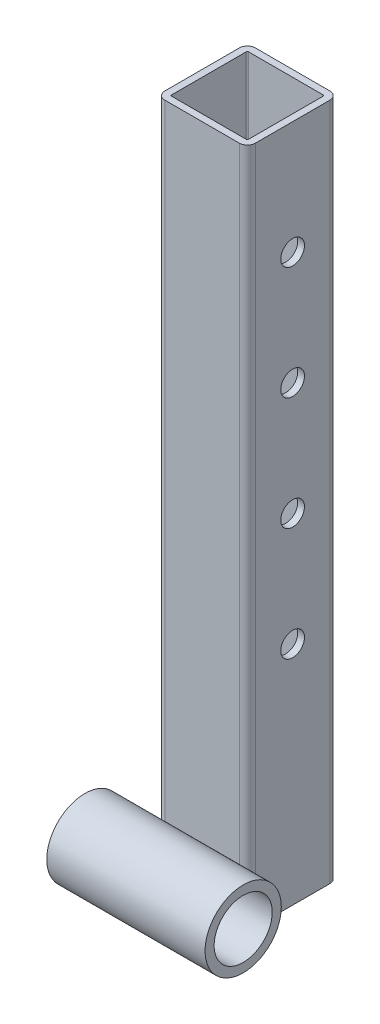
ISO-10303-21;
HEADER;
FILE_DESCRIPTION(('STEP AP214'),'2;1');
FILE_NAME('part.step','',(''),(''),'','','');
FILE_SCHEMA(('AUTOMOTIVE_DESIGN { 1 0 10303 214 1 1 1 1 }'));
ENDSEC;
DATA;
#1=APPLICATION_CONTEXT('core data for automotive mechanical design processes');
#2=APPLICATION_PROTOCOL_DEFINITION('international standard','automotive_design',2000,#1);
#3=PRODUCT_CONTEXT('',#1,'mechanical');
#4=PRODUCT('Part','Part','',(#3));
#5=PRODUCT_RELATED_PRODUCT_CATEGORY('part','',(#4));
#6=PRODUCT_DEFINITION_FORMATION('','',#4);
#7=PRODUCT_DEFINITION_CONTEXT('part definition',#1,'design');
#8=PRODUCT_DEFINITION('design','',#6,#7);
#9=PRODUCT_DEFINITION_SHAPE('','',#8);
#10=(LENGTH_UNIT() NAMED_UNIT(*) SI_UNIT(.MILLI.,.METRE.));
#11=(NAMED_UNIT(*) PLANE_ANGLE_UNIT() SI_UNIT($,.RADIAN.));
#12=(NAMED_UNIT(*) SI_UNIT($,.STERADIAN.) SOLID_ANGLE_UNIT());
#13=UNCERTAINTY_MEASURE_WITH_UNIT(LENGTH_MEASURE(1.E-05),#10,'distance_accuracy_value','');
#14=(GEOMETRIC_REPRESENTATION_CONTEXT(3) GLOBAL_UNCERTAINTY_ASSIGNED_CONTEXT((#13)) GLOBAL_UNIT_ASSIGNED_CONTEXT((#10,
#11,#12)) REPRESENTATION_CONTEXT('',''));
#15=CARTESIAN_POINT('',(0.,0.,0.));
#16=DIRECTION('',(0.,0.,1.));
#17=DIRECTION('',(1.,0.,0.));
#18=AXIS2_PLACEMENT_3D('',#15,#16,#17);
#19=CARTESIAN_POINT('',(-35.,16.85,36.85));
#20=DIRECTION('',(1.,0.,0.));
#21=DIRECTION('',(0.,0.,-1.));
#22=AXIS2_PLACEMENT_3D('',#19,#20,#21);
#23=CYLINDRICAL_SURFACE('',#22,16.85);
#24=CARTESIAN_POINT('',(-35.,16.85,36.85));
#25=DIRECTION('',(1.,0.,0.));
#26=DIRECTION('',(0.,0.,-1.));
#27=AXIS2_PLACEMENT_3D('',#24,#25,#26);
#28=CIRCLE('',#27,16.85);
#29=CARTESIAN_POINT('',(-35.,16.85,20.));
#30=VERTEX_POINT('',#29);
#31=EDGE_CURVE('E12',#30,#30,#28,.T.);
#32=ORIENTED_EDGE('',*,*,#31,.T.);
#33=EDGE_LOOP('',(#32));
#34=FACE_BOUND('',#33,.T.);
#35=CARTESIAN_POINT('',(35.,16.85,36.85));
#36=DIRECTION('',(1.,0.,0.));
#37=DIRECTION('',(0.,0.,-1.));
#38=AXIS2_PLACEMENT_3D('',#35,#36,#37);
#39=CIRCLE('',#38,16.85);
#40=CARTESIAN_POINT('',(35.,16.85,20.));
#41=VERTEX_POINT('',#40);
#42=EDGE_CURVE('E77',#41,#41,#39,.T.);
#43=ORIENTED_EDGE('',*,*,#42,.F.);
#44=EDGE_LOOP('',(#43));
#45=FACE_BOUND('',#44,.T.);
#46=ADVANCED_FACE('F67',(#34,#45),#23,.T.);
#47=CARTESIAN_POINT('',(-35.,16.85,36.85));
#48=DIRECTION('',(1.,0.,0.));
#49=DIRECTION('',(0.,0.,-1.));
#50=AXIS2_PLACEMENT_3D('',#47,#48,#49);
#51=PLANE('',#50);
#52=CARTESIAN_POINT('',(-35.,16.85,36.85));
#53=DIRECTION('',(1.,0.,0.));
#54=DIRECTION('',(0.,0.,-1.));
#55=AXIS2_PLACEMENT_3D('',#52,#53,#54);
#56=CIRCLE('',#55,12.85);
#57=CARTESIAN_POINT('',(-35.,16.85,24.));
#58=VERTEX_POINT('',#57);
#59=EDGE_CURVE('E73',#58,#58,#56,.T.);
#60=ORIENTED_EDGE('',*,*,#59,.T.);
#61=EDGE_LOOP('',(#60));
#62=FACE_BOUND('',#61,.T.);
#63=ORIENTED_EDGE('',*,*,#31,.F.);
#64=EDGE_LOOP('',(#63));
#65=FACE_BOUND('',#64,.T.);
#66=ADVANCED_FACE('F96',(#62,#65),#51,.F.);
#67=CARTESIAN_POINT('',(-35.,16.85,36.85));
#68=DIRECTION('',(1.,0.,0.));
#69=DIRECTION('',(0.,0.,-1.));
#70=AXIS2_PLACEMENT_3D('',#67,#68,#69);
#71=CYLINDRICAL_SURFACE('',#70,12.85);
#72=ORIENTED_EDGE('',*,*,#59,.F.);
#73=EDGE_LOOP('',(#72));
#74=FACE_BOUND('',#73,.T.);
#75=CARTESIAN_POINT('',(35.,16.85,36.85));
#76=DIRECTION('',(1.,0.,0.));
#77=DIRECTION('',(0.,0.,-1.));
#78=AXIS2_PLACEMENT_3D('',#75,#76,#77);
#79=CIRCLE('',#78,12.85);
#80=CARTESIAN_POINT('',(35.,16.85,24.));
#81=VERTEX_POINT('',#80);
#82=EDGE_CURVE('E81',#81,#81,#79,.T.);
#83=ORIENTED_EDGE('',*,*,#82,.T.);
#84=EDGE_LOOP('',(#83));
#85=FACE_BOUND('',#84,.T.);
#86=ADVANCED_FACE('F87',(#74,#85),#71,.F.);
#87=CARTESIAN_POINT('',(35.,16.85,36.85));
#88=DIRECTION('',(1.,0.,0.));
#89=DIRECTION('',(0.,0.,-1.));
#90=AXIS2_PLACEMENT_3D('',#87,#88,#89);
#91=PLANE('',#90);
#92=ORIENTED_EDGE('',*,*,#42,.T.);
#93=EDGE_LOOP('',(#92));
#94=FACE_BOUND('',#93,.T.);
#95=ORIENTED_EDGE('',*,*,#82,.F.);
#96=EDGE_LOOP('',(#95));
#97=FACE_BOUND('',#96,.T.);
#98=ADVANCED_FACE('F89',(#94,#97),#91,.T.);
#99=CLOSED_SHELL('',(#46,#66,#86,#98));
#100=MANIFOLD_SOLID_BREP('B2',#99);
#101=CARTESIAN_POINT('',(-16.5,300.,16.5));
#102=DIRECTION('',(0.,-1.,0.));
#103=DIRECTION('',(0.,0.,-1.));
#104=AXIS2_PLACEMENT_3D('',#101,#102,#103);
#105=CYLINDRICAL_SURFACE('',#104,3.5);
#106=CARTESIAN_POINT('',(-16.5,0.,16.5));
#107=DIRECTION('',(0.,1.,0.));
#108=DIRECTION('',(0.,0.,1.));
#109=AXIS2_PLACEMENT_3D('',#106,#107,#108);
#110=CIRCLE('',#109,3.5);
#111=CARTESIAN_POINT('',(-20.,0.,16.5));
#112=VERTEX_POINT('',#111);
#113=CARTESIAN_POINT('',(-16.5,0.,20.));
#114=VERTEX_POINT('',#113);
#115=EDGE_CURVE('E302',#112,#114,#110,.T.);
#116=ORIENTED_EDGE('',*,*,#115,.T.);
#117=DIRECTION('',(0.,-1.,0.));
#118=VECTOR('',#117,1.);
#119=CARTESIAN_POINT('',(-16.5,300.,20.));
#120=LINE('',#119,#118);
#121=CARTESIAN_POINT('',(-16.5,300.,20.));
#122=VERTEX_POINT('',#121);
#123=EDGE_CURVE('E65',#122,#114,#120,.T.);
#124=ORIENTED_EDGE('',*,*,#123,.F.);
#125=CARTESIAN_POINT('',(-16.5,300.,16.5));
#126=DIRECTION('',(0.,1.,0.));
#127=DIRECTION('',(0.,0.,1.));
#128=AXIS2_PLACEMENT_3D('',#125,#126,#127);
#129=CIRCLE('',#128,3.5);
#130=CARTESIAN_POINT('',(-20.,300.,16.5));
#131=VERTEX_POINT('',#130);
#132=EDGE_CURVE('E380',#131,#122,#129,.T.);
#133=ORIENTED_EDGE('',*,*,#132,.F.);
#134=DIRECTION('',(0.,-1.,0.));
#135=VECTOR('',#134,1.);
#136=CARTESIAN_POINT('',(-20.,300.,16.5));
#137=LINE('',#136,#135);
#138=EDGE_CURVE('E317',#131,#112,#137,.T.);
#139=ORIENTED_EDGE('',*,*,#138,.T.);
#140=EDGE_LOOP('',(#116,#124,#133,#139));
#141=FACE_BOUND('',#140,.T.);
#142=ADVANCED_FACE('F129',(#141),#105,.T.);
#143=CARTESIAN_POINT('',(-16.5,300.,20.));
#144=DIRECTION('',(0.,0.,-1.));
#145=DIRECTION('',(-1.,0.,0.));
#146=AXIS2_PLACEMENT_3D('',#143,#144,#145);
#147=PLANE('',#146);
#148=DIRECTION('',(1.,0.,0.));
#149=VECTOR('',#148,1.);
#150=CARTESIAN_POINT('',(-16.5,0.,20.));
#151=LINE('',#150,#149);
#152=CARTESIAN_POINT('',(16.5,0.,20.));
#153=VERTEX_POINT('',#152);
#154=EDGE_CURVE('E305',#114,#153,#151,.T.);
#155=ORIENTED_EDGE('',*,*,#154,.T.);
#156=DIRECTION('',(0.,-1.,0.));
#157=VECTOR('',#156,1.);
#158=CARTESIAN_POINT('',(16.5,300.,20.));
#159=LINE('',#158,#157);
#160=CARTESIAN_POINT('',(16.5,300.,20.));
#161=VERTEX_POINT('',#160);
#162=EDGE_CURVE('E139',#161,#153,#159,.T.);
#163=ORIENTED_EDGE('',*,*,#162,.F.);
#164=DIRECTION('',(1.,0.,0.));
#165=VECTOR('',#164,1.);
#166=CARTESIAN_POINT('',(-16.5,300.,20.));
#167=LINE('',#166,#165);
#168=EDGE_CURVE('E382',#122,#161,#167,.T.);
#169=ORIENTED_EDGE('',*,*,#168,.F.);
#170=ORIENTED_EDGE('',*,*,#123,.T.);
#171=EDGE_LOOP('',(#155,#163,#169,#170));
#172=FACE_BOUND('',#171,.T.);
#173=ADVANCED_FACE('F417',(#172),#147,.F.);
#174=CARTESIAN_POINT('',(16.5,300.,16.5));
#175=DIRECTION('',(0.,-1.,0.));
#176=DIRECTION('',(0.,0.,-1.));
#177=AXIS2_PLACEMENT_3D('',#174,#175,#176);
#178=CYLINDRICAL_SURFACE('',#177,3.5);
#179=CARTESIAN_POINT('',(16.5,0.,16.5));
#180=DIRECTION('',(0.,1.,0.));
#181=DIRECTION('',(0.,0.,1.));
#182=AXIS2_PLACEMENT_3D('',#179,#180,#181);
#183=CIRCLE('',#182,3.5);
#184=CARTESIAN_POINT('',(20.,0.,16.5));
#185=VERTEX_POINT('',#184);
#186=EDGE_CURVE('E307',#153,#185,#183,.T.);
#187=ORIENTED_EDGE('',*,*,#186,.T.);
#188=DIRECTION('',(0.,-1.,0.));
#189=VECTOR('',#188,1.);
#190=CARTESIAN_POINT('',(20.,300.,16.5));
#191=LINE('',#190,#189);
#192=CARTESIAN_POINT('',(20.,300.,16.5));
#193=VERTEX_POINT('',#192);
#194=EDGE_CURVE('E324',#193,#185,#191,.T.);
#195=ORIENTED_EDGE('',*,*,#194,.F.);
#196=CARTESIAN_POINT('',(16.5,300.,16.5));
#197=DIRECTION('',(0.,1.,0.));
#198=DIRECTION('',(0.,0.,1.));
#199=AXIS2_PLACEMENT_3D('',#196,#197,#198);
#200=CIRCLE('',#199,3.5);
#201=EDGE_CURVE('E384',#161,#193,#200,.T.);
#202=ORIENTED_EDGE('',*,*,#201,.F.);
#203=ORIENTED_EDGE('',*,*,#162,.T.);
#204=EDGE_LOOP('',(#187,#195,#202,#203));
#205=FACE_BOUND('',#204,.T.);
#206=ADVANCED_FACE('F422',(#205),#178,.T.);
#207=CARTESIAN_POINT('',(20.,300.,-16.5));
#208=DIRECTION('',(-1.,0.,0.));
#209=DIRECTION('',(0.,0.,1.));
#210=AXIS2_PLACEMENT_3D('',#207,#208,#209);
#211=PLANE('',#210);
#212=CARTESIAN_POINT('',(20.,99.9999999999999,0.));
#213=DIRECTION('',(1.,0.,0.));
#214=DIRECTION('',(0.,0.,-1.));
#215=AXIS2_PLACEMENT_3D('',#212,#213,#214);
#216=CIRCLE('',#215,5.25000000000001);
#217=CARTESIAN_POINT('',(20.,99.9999999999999,-5.25000000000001));
#218=VERTEX_POINT('',#217);
#219=EDGE_CURVE('E599',#218,#218,#216,.T.);
#220=ORIENTED_EDGE('',*,*,#219,.F.);
#221=EDGE_LOOP('',(#220));
#222=FACE_BOUND('',#221,.T.);
#223=CARTESIAN_POINT('',(20.,150.,0.));
#224=DIRECTION('',(1.,0.,0.));
#225=DIRECTION('',(0.,0.,-1.));
#226=AXIS2_PLACEMENT_3D('',#223,#224,#225);
#227=CIRCLE('',#226,5.25000000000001);
#228=CARTESIAN_POINT('',(20.,150.,-5.24999999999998));
#229=VERTEX_POINT('',#228);
#230=EDGE_CURVE('E603',#229,#229,#227,.T.);
#231=ORIENTED_EDGE('',*,*,#230,.F.);
#232=EDGE_LOOP('',(#231));
#233=FACE_BOUND('',#232,.T.);
#234=CARTESIAN_POINT('',(20.,200.,0.));
#235=DIRECTION('',(1.,0.,0.));
#236=DIRECTION('',(0.,0.,-1.));
#237=AXIS2_PLACEMENT_3D('',#234,#235,#236);
#238=CIRCLE('',#237,5.25000000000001);
#239=CARTESIAN_POINT('',(20.,200.,-5.24999999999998));
#240=VERTEX_POINT('',#239);
#241=EDGE_CURVE('E612',#240,#240,#238,.T.);
#242=ORIENTED_EDGE('',*,*,#241,.F.);
#243=EDGE_LOOP('',(#242));
#244=FACE_BOUND('',#243,.T.);
#245=CARTESIAN_POINT('',(20.,250.,0.));
#246=DIRECTION('',(1.,0.,0.));
#247=DIRECTION('',(0.,0.,-1.));
#248=AXIS2_PLACEMENT_3D('',#245,#246,#247);
#249=CIRCLE('',#248,5.25);
#250=CARTESIAN_POINT('',(20.,250.,-5.25));
#251=VERTEX_POINT('',#250);
#252=EDGE_CURVE('E281',#251,#251,#249,.T.);
#253=ORIENTED_EDGE('',*,*,#252,.F.);
#254=EDGE_LOOP('',(#253));
#255=FACE_BOUND('',#254,.T.);
#256=DIRECTION('',(0.,0.,-1.));
#257=VECTOR('',#256,1.);
#258=CARTESIAN_POINT('',(20.,0.,-16.5));
#259=LINE('',#258,#257);
#260=CARTESIAN_POINT('',(20.,0.,-16.5));
#261=VERTEX_POINT('',#260);
#262=EDGE_CURVE('E309',#185,#261,#259,.T.);
#263=ORIENTED_EDGE('',*,*,#262,.T.);
#264=DIRECTION('',(0.,-1.,0.));
#265=VECTOR('',#264,1.);
#266=CARTESIAN_POINT('',(20.,300.,-16.5));
#267=LINE('',#266,#265);
#268=CARTESIAN_POINT('',(20.,300.,-16.5));
#269=VERTEX_POINT('',#268);
#270=EDGE_CURVE('E321',#269,#261,#267,.T.);
#271=ORIENTED_EDGE('',*,*,#270,.F.);
#272=DIRECTION('',(0.,0.,-1.));
#273=VECTOR('',#272,1.);
#274=CARTESIAN_POINT('',(20.,300.,-16.5));
#275=LINE('',#274,#273);
#276=EDGE_CURVE('E386',#193,#269,#275,.T.);
#277=ORIENTED_EDGE('',*,*,#276,.F.);
#278=ORIENTED_EDGE('',*,*,#194,.T.);
#279=EDGE_LOOP('',(#263,#271,#277,#278));
#280=FACE_BOUND('',#279,.T.);
#281=ADVANCED_FACE('F392',(#222,#233,#244,#255,#280),#211,.F.);
#282=CARTESIAN_POINT('',(16.5,300.,-16.5));
#283=DIRECTION('',(0.,-1.,0.));
#284=DIRECTION('',(0.,0.,-1.));
#285=AXIS2_PLACEMENT_3D('',#282,#283,#284);
#286=CYLINDRICAL_SURFACE('',#285,3.5);
#287=CARTESIAN_POINT('',(16.5,0.,-16.5));
#288=DIRECTION('',(0.,1.,0.));
#289=DIRECTION('',(0.,0.,1.));
#290=AXIS2_PLACEMENT_3D('',#287,#288,#289);
#291=CIRCLE('',#290,3.5);
#292=CARTESIAN_POINT('',(16.5,0.,-20.));
#293=VERTEX_POINT('',#292);
#294=EDGE_CURVE('E311',#261,#293,#291,.T.);
#295=ORIENTED_EDGE('',*,*,#294,.T.);
#296=DIRECTION('',(0.,-1.,0.));
#297=VECTOR('',#296,1.);
#298=CARTESIAN_POINT('',(16.5,300.,-20.));
#299=LINE('',#298,#297);
#300=CARTESIAN_POINT('',(16.5,300.,-20.));
#301=VERTEX_POINT('',#300);
#302=EDGE_CURVE('E268',#301,#293,#299,.T.);
#303=ORIENTED_EDGE('',*,*,#302,.F.);
#304=CARTESIAN_POINT('',(16.5,300.,-16.5));
#305=DIRECTION('',(0.,1.,0.));
#306=DIRECTION('',(0.,0.,1.));
#307=AXIS2_PLACEMENT_3D('',#304,#305,#306);
#308=CIRCLE('',#307,3.5);
#309=EDGE_CURVE('E259',#269,#301,#308,.T.);
#310=ORIENTED_EDGE('',*,*,#309,.F.);
#311=ORIENTED_EDGE('',*,*,#270,.T.);
#312=EDGE_LOOP('',(#295,#303,#310,#311));
#313=FACE_BOUND('',#312,.T.);
#314=ADVANCED_FACE('F396',(#313),#286,.T.);
#315=CARTESIAN_POINT('',(16.5,300.,-20.));
#316=DIRECTION('',(0.,0.,1.));
#317=DIRECTION('',(1.,0.,0.));
#318=AXIS2_PLACEMENT_3D('',#315,#316,#317);
#319=PLANE('',#318);
#320=DIRECTION('',(-1.,0.,0.));
#321=VECTOR('',#320,1.);
#322=CARTESIAN_POINT('',(16.5,0.,-20.));
#323=LINE('',#322,#321);
#324=CARTESIAN_POINT('',(-16.5,0.,-20.));
#325=VERTEX_POINT('',#324);
#326=EDGE_CURVE('E267',#293,#325,#323,.T.);
#327=ORIENTED_EDGE('',*,*,#326,.T.);
#328=DIRECTION('',(0.,-1.,0.));
#329=VECTOR('',#328,1.);
#330=CARTESIAN_POINT('',(-16.5,300.,-20.));
#331=LINE('',#330,#329);
#332=CARTESIAN_POINT('',(-16.5,300.,-20.));
#333=VERTEX_POINT('',#332);
#334=EDGE_CURVE('E264',#333,#325,#331,.T.);
#335=ORIENTED_EDGE('',*,*,#334,.F.);
#336=DIRECTION('',(-1.,0.,0.));
#337=VECTOR('',#336,1.);
#338=CARTESIAN_POINT('',(16.5,300.,-20.));
#339=LINE('',#338,#337);
#340=EDGE_CURVE('E253',#301,#333,#339,.T.);
#341=ORIENTED_EDGE('',*,*,#340,.F.);
#342=ORIENTED_EDGE('',*,*,#302,.T.);
#343=EDGE_LOOP('',(#327,#335,#341,#342));
#344=FACE_BOUND('',#343,.T.);
#345=ADVANCED_FACE('F265',(#344),#319,.F.);
#346=CARTESIAN_POINT('',(-16.5,300.,-16.5));
#347=DIRECTION('',(0.,-1.,0.));
#348=DIRECTION('',(0.,0.,-1.));
#349=AXIS2_PLACEMENT_3D('',#346,#347,#348);
#350=CYLINDRICAL_SURFACE('',#349,3.5);
#351=CARTESIAN_POINT('',(-16.5,0.,-16.5));
#352=DIRECTION('',(0.,1.,0.));
#353=DIRECTION('',(0.,0.,1.));
#354=AXIS2_PLACEMENT_3D('',#351,#352,#353);
#355=CIRCLE('',#354,3.5);
#356=CARTESIAN_POINT('',(-20.,0.,-16.5));
#357=VERTEX_POINT('',#356);
#358=EDGE_CURVE('E201',#325,#357,#355,.T.);
#359=ORIENTED_EDGE('',*,*,#358,.T.);
#360=DIRECTION('',(0.,-1.,0.));
#361=VECTOR('',#360,1.);
#362=CARTESIAN_POINT('',(-20.,300.,-16.5));
#363=LINE('',#362,#361);
#364=CARTESIAN_POINT('',(-20.,300.,-16.5));
#365=VERTEX_POINT('',#364);
#366=EDGE_CURVE('E269',#365,#357,#363,.T.);
#367=ORIENTED_EDGE('',*,*,#366,.F.);
#368=CARTESIAN_POINT('',(-16.5,300.,-16.5));
#369=DIRECTION('',(0.,1.,0.));
#370=DIRECTION('',(0.,0.,1.));
#371=AXIS2_PLACEMENT_3D('',#368,#369,#370);
#372=CIRCLE('',#371,3.5);
#373=EDGE_CURVE('E257',#333,#365,#372,.T.);
#374=ORIENTED_EDGE('',*,*,#373,.F.);
#375=ORIENTED_EDGE('',*,*,#334,.T.);
#376=EDGE_LOOP('',(#359,#367,#374,#375));
#377=FACE_BOUND('',#376,.T.);
#378=ADVANCED_FACE('F271',(#377),#350,.T.);
#379=CARTESIAN_POINT('',(16.5,300.,16.5));
#380=DIRECTION('',(0.,-1.,0.));
#381=DIRECTION('',(0.,0.,-1.));
#382=AXIS2_PLACEMENT_3D('',#379,#380,#381);
#383=CYLINDRICAL_SURFACE('',#382,0.500000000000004);
#384=CARTESIAN_POINT('',(16.5,0.,16.5));
#385=DIRECTION('',(0.,1.,0.));
#386=DIRECTION('',(0.,0.,1.));
#387=AXIS2_PLACEMENT_3D('',#384,#385,#386);
#388=CIRCLE('',#387,0.500000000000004);
#389=CARTESIAN_POINT('',(16.5,0.,17.));
#390=VERTEX_POINT('',#389);
#391=CARTESIAN_POINT('',(17.,0.,16.5));
#392=VERTEX_POINT('',#391);
#393=EDGE_CURVE('E277',#390,#392,#388,.T.);
#394=ORIENTED_EDGE('',*,*,#393,.F.);
#395=DIRECTION('',(0.,-1.,0.));
#396=VECTOR('',#395,1.);
#397=CARTESIAN_POINT('',(16.5,300.,17.));
#398=LINE('',#397,#396);
#399=CARTESIAN_POINT('',(16.5,300.,17.));
#400=VERTEX_POINT('',#399);
#401=EDGE_CURVE('E133',#400,#390,#398,.T.);
#402=ORIENTED_EDGE('',*,*,#401,.F.);
#403=CARTESIAN_POINT('',(16.5,300.,16.5));
#404=DIRECTION('',(0.,1.,0.));
#405=DIRECTION('',(0.,0.,1.));
#406=AXIS2_PLACEMENT_3D('',#403,#404,#405);
#407=CIRCLE('',#406,0.500000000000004);
#408=CARTESIAN_POINT('',(17.,300.,16.5));
#409=VERTEX_POINT('',#408);
#410=EDGE_CURVE('E316',#400,#409,#407,.T.);
#411=ORIENTED_EDGE('',*,*,#410,.T.);
#412=DIRECTION('',(0.,-1.,0.));
#413=VECTOR('',#412,1.);
#414=CARTESIAN_POINT('',(17.,300.,16.5));
#415=LINE('',#414,#413);
#416=EDGE_CURVE('E273',#409,#392,#415,.T.);
#417=ORIENTED_EDGE('',*,*,#416,.T.);
#418=EDGE_LOOP('',(#394,#402,#411,#417));
#419=FACE_BOUND('',#418,.T.);
#420=ADVANCED_FACE('F131',(#419),#383,.F.);
#421=CARTESIAN_POINT('',(-16.5,300.,17.));
#422=DIRECTION('',(0.,0.,-1.));
#423=DIRECTION('',(-1.,0.,0.));
#424=AXIS2_PLACEMENT_3D('',#421,#422,#423);
#425=PLANE('',#424);
#426=DIRECTION('',(1.,0.,0.));
#427=VECTOR('',#426,1.);
#428=CARTESIAN_POINT('',(-16.5,0.,17.));
#429=LINE('',#428,#427);
#430=CARTESIAN_POINT('',(-16.5,0.,17.));
#431=VERTEX_POINT('',#430);
#432=EDGE_CURVE('E280',#431,#390,#429,.T.);
#433=ORIENTED_EDGE('',*,*,#432,.F.);
#434=DIRECTION('',(0.,-1.,0.));
#435=VECTOR('',#434,1.);
#436=CARTESIAN_POINT('',(-16.5,300.,17.));
#437=LINE('',#436,#435);
#438=CARTESIAN_POINT('',(-16.5,300.,17.));
#439=VERTEX_POINT('',#438);
#440=EDGE_CURVE('E339',#439,#431,#437,.T.);
#441=ORIENTED_EDGE('',*,*,#440,.F.);
#442=DIRECTION('',(1.,0.,0.));
#443=VECTOR('',#442,1.);
#444=CARTESIAN_POINT('',(-16.5,300.,17.));
#445=LINE('',#444,#443);
#446=EDGE_CURVE('E348',#439,#400,#445,.T.);
#447=ORIENTED_EDGE('',*,*,#446,.T.);
#448=ORIENTED_EDGE('',*,*,#401,.T.);
#449=EDGE_LOOP('',(#433,#441,#447,#448));
#450=FACE_BOUND('',#449,.T.);
#451=ADVANCED_FACE('F346',(#450),#425,.T.);
#452=CARTESIAN_POINT('',(-16.5,300.,16.5));
#453=DIRECTION('',(0.,-1.,0.));
#454=DIRECTION('',(0.,0.,-1.));
#455=AXIS2_PLACEMENT_3D('',#452,#453,#454);
#456=CYLINDRICAL_SURFACE('',#455,0.500000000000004);
#457=CARTESIAN_POINT('',(-16.5,0.,16.5));
#458=DIRECTION('',(0.,1.,0.));
#459=DIRECTION('',(0.,0.,1.));
#460=AXIS2_PLACEMENT_3D('',#457,#458,#459);
#461=CIRCLE('',#460,0.500000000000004);
#462=CARTESIAN_POINT('',(-17.,0.,16.5));
#463=VERTEX_POINT('',#462);
#464=EDGE_CURVE('E284',#463,#431,#461,.T.);
#465=ORIENTED_EDGE('',*,*,#464,.F.);
#466=DIRECTION('',(0.,-1.,0.));
#467=VECTOR('',#466,1.);
#468=CARTESIAN_POINT('',(-17.,300.,16.5));
#469=LINE('',#468,#467);
#470=CARTESIAN_POINT('',(-17.,300.,16.5));
#471=VERTEX_POINT('',#470);
#472=EDGE_CURVE('E338',#471,#463,#469,.T.);
#473=ORIENTED_EDGE('',*,*,#472,.F.);
#474=CARTESIAN_POINT('',(-16.5,300.,16.5));
#475=DIRECTION('',(0.,1.,0.));
#476=DIRECTION('',(0.,0.,1.));
#477=AXIS2_PLACEMENT_3D('',#474,#475,#476);
#478=CIRCLE('',#477,0.500000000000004);
#479=EDGE_CURVE('E356',#471,#439,#478,.T.);
#480=ORIENTED_EDGE('',*,*,#479,.T.);
#481=ORIENTED_EDGE('',*,*,#440,.T.);
#482=EDGE_LOOP('',(#465,#473,#480,#481));
#483=FACE_BOUND('',#482,.T.);
#484=ADVANCED_FACE('F354',(#483),#456,.F.);
#485=CARTESIAN_POINT('',(-17.,300.,16.5));
#486=DIRECTION('',(1.,0.,0.));
#487=DIRECTION('',(0.,0.,-1.));
#488=AXIS2_PLACEMENT_3D('',#485,#486,#487);
#489=PLANE('',#488);
#490=DIRECTION('',(0.,0.,1.));
#491=VECTOR('',#490,1.);
#492=CARTESIAN_POINT('',(-17.,0.,16.5));
#493=LINE('',#492,#491);
#494=CARTESIAN_POINT('',(-17.,0.,-16.5));
#495=VERTEX_POINT('',#494);
#496=EDGE_CURVE('E287',#495,#463,#493,.T.);
#497=ORIENTED_EDGE('',*,*,#496,.F.);
#498=DIRECTION('',(0.,-1.,0.));
#499=VECTOR('',#498,1.);
#500=CARTESIAN_POINT('',(-17.,300.,-16.5));
#501=LINE('',#500,#499);
#502=CARTESIAN_POINT('',(-17.,300.,-16.5));
#503=VERTEX_POINT('',#502);
#504=EDGE_CURVE('E336',#503,#495,#501,.T.);
#505=ORIENTED_EDGE('',*,*,#504,.F.);
#506=DIRECTION('',(0.,0.,1.));
#507=VECTOR('',#506,1.);
#508=CARTESIAN_POINT('',(-17.,300.,16.5));
#509=LINE('',#508,#507);
#510=EDGE_CURVE('E362',#503,#471,#509,.T.);
#511=ORIENTED_EDGE('',*,*,#510,.T.);
#512=ORIENTED_EDGE('',*,*,#472,.T.);
#513=EDGE_LOOP('',(#497,#505,#511,#512));
#514=FACE_BOUND('',#513,.T.);
#515=ADVANCED_FACE('F365',(#514),#489,.T.);
#516=CARTESIAN_POINT('',(-16.5,300.,-16.5));
#517=DIRECTION('',(0.,-1.,0.));
#518=DIRECTION('',(0.,0.,-1.));
#519=AXIS2_PLACEMENT_3D('',#516,#517,#518);
#520=CYLINDRICAL_SURFACE('',#519,0.500000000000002);
#521=CARTESIAN_POINT('',(-16.5,0.,-16.5));
#522=DIRECTION('',(0.,1.,0.));
#523=DIRECTION('',(0.,0.,1.));
#524=AXIS2_PLACEMENT_3D('',#521,#522,#523);
#525=CIRCLE('',#524,0.500000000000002);
#526=CARTESIAN_POINT('',(-16.5,0.,-17.));
#527=VERTEX_POINT('',#526);
#528=EDGE_CURVE('E290',#527,#495,#525,.T.);
#529=ORIENTED_EDGE('',*,*,#528,.F.);
#530=DIRECTION('',(0.,-1.,0.));
#531=VECTOR('',#530,1.);
#532=CARTESIAN_POINT('',(-16.5,300.,-17.));
#533=LINE('',#532,#531);
#534=CARTESIAN_POINT('',(-16.5,300.,-17.));
#535=VERTEX_POINT('',#534);
#536=EDGE_CURVE('E334',#535,#527,#533,.T.);
#537=ORIENTED_EDGE('',*,*,#536,.F.);
#538=CARTESIAN_POINT('',(-16.5,300.,-16.5));
#539=DIRECTION('',(0.,1.,0.));
#540=DIRECTION('',(0.,0.,1.));
#541=AXIS2_PLACEMENT_3D('',#538,#539,#540);
#542=CIRCLE('',#541,0.500000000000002);
#543=EDGE_CURVE('E366',#535,#503,#542,.T.);
#544=ORIENTED_EDGE('',*,*,#543,.T.);
#545=ORIENTED_EDGE('',*,*,#504,.T.);
#546=EDGE_LOOP('',(#529,#537,#544,#545));
#547=FACE_BOUND('',#546,.T.);
#548=ADVANCED_FACE('F433',(#547),#520,.F.);
#549=CARTESIAN_POINT('',(16.5,300.,-17.));
#550=DIRECTION('',(0.,0.,1.));
#551=DIRECTION('',(1.,0.,0.));
#552=AXIS2_PLACEMENT_3D('',#549,#550,#551);
#553=PLANE('',#552);
#554=DIRECTION('',(-1.,0.,0.));
#555=VECTOR('',#554,1.);
#556=CARTESIAN_POINT('',(16.5,0.,-17.));
#557=LINE('',#556,#555);
#558=CARTESIAN_POINT('',(16.5,0.,-17.));
#559=VERTEX_POINT('',#558);
#560=EDGE_CURVE('E293',#559,#527,#557,.T.);
#561=ORIENTED_EDGE('',*,*,#560,.F.);
#562=DIRECTION('',(0.,-1.,0.));
#563=VECTOR('',#562,1.);
#564=CARTESIAN_POINT('',(16.5,300.,-17.));
#565=LINE('',#564,#563);
#566=CARTESIAN_POINT('',(16.5,300.,-17.));
#567=VERTEX_POINT('',#566);
#568=EDGE_CURVE('E332',#567,#559,#565,.T.);
#569=ORIENTED_EDGE('',*,*,#568,.F.);
#570=DIRECTION('',(-1.,0.,0.));
#571=VECTOR('',#570,1.);
#572=CARTESIAN_POINT('',(16.5,300.,-17.));
#573=LINE('',#572,#571);
#574=EDGE_CURVE('E368',#567,#535,#573,.T.);
#575=ORIENTED_EDGE('',*,*,#574,.T.);
#576=ORIENTED_EDGE('',*,*,#536,.T.);
#577=EDGE_LOOP('',(#561,#569,#575,#576));
#578=FACE_BOUND('',#577,.T.);
#579=ADVANCED_FACE('F429',(#578),#553,.T.);
#580=CARTESIAN_POINT('',(16.5,300.,-16.5));
#581=DIRECTION('',(0.,-1.,0.));
#582=DIRECTION('',(0.,0.,-1.));
#583=AXIS2_PLACEMENT_3D('',#580,#581,#582);
#584=CYLINDRICAL_SURFACE('',#583,0.5);
#585=CARTESIAN_POINT('',(16.5,0.,-16.5));
#586=DIRECTION('',(0.,1.,0.));
#587=DIRECTION('',(0.,0.,1.));
#588=AXIS2_PLACEMENT_3D('',#585,#586,#587);
#589=CIRCLE('',#588,0.5);
#590=CARTESIAN_POINT('',(17.,0.,-16.5));
#591=VERTEX_POINT('',#590);
#592=EDGE_CURVE('E296',#591,#559,#589,.T.);
#593=ORIENTED_EDGE('',*,*,#592,.F.);
#594=DIRECTION('',(0.,-1.,0.));
#595=VECTOR('',#594,1.);
#596=CARTESIAN_POINT('',(17.,300.,-16.5));
#597=LINE('',#596,#595);
#598=CARTESIAN_POINT('',(17.,300.,-16.5));
#599=VERTEX_POINT('',#598);
#600=EDGE_CURVE('E330',#599,#591,#597,.T.);
#601=ORIENTED_EDGE('',*,*,#600,.F.);
#602=CARTESIAN_POINT('',(16.5,300.,-16.5));
#603=DIRECTION('',(0.,1.,0.));
#604=DIRECTION('',(0.,0.,1.));
#605=AXIS2_PLACEMENT_3D('',#602,#603,#604);
#606=CIRCLE('',#605,0.5);
#607=EDGE_CURVE('E374',#599,#567,#606,.T.);
#608=ORIENTED_EDGE('',*,*,#607,.T.);
#609=ORIENTED_EDGE('',*,*,#568,.T.);
#610=EDGE_LOOP('',(#593,#601,#608,#609));
#611=FACE_BOUND('',#610,.T.);
#612=ADVANCED_FACE('F411',(#611),#584,.F.);
#613=CARTESIAN_POINT('',(17.,300.,-16.5));
#614=DIRECTION('',(-1.,0.,0.));
#615=DIRECTION('',(0.,0.,1.));
#616=AXIS2_PLACEMENT_3D('',#613,#614,#615);
#617=PLANE('',#616);
#618=CARTESIAN_POINT('',(17.,99.9999999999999,0.));
#619=DIRECTION('',(-1.,0.,0.));
#620=DIRECTION('',(0.,0.,1.));
#621=AXIS2_PLACEMENT_3D('',#618,#619,#620);
#622=CIRCLE('',#621,5.25000000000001);
#623=CARTESIAN_POINT('',(17.,99.9999999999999,5.25000000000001));
#624=VERTEX_POINT('',#623);
#625=EDGE_CURVE('E596',#624,#624,#622,.F.);
#626=ORIENTED_EDGE('',*,*,#625,.T.);
#627=EDGE_LOOP('',(#626));
#628=FACE_BOUND('',#627,.T.);
#629=CARTESIAN_POINT('',(17.,150.,0.));
#630=DIRECTION('',(-1.,0.,0.));
#631=DIRECTION('',(0.,0.,1.));
#632=AXIS2_PLACEMENT_3D('',#629,#630,#631);
#633=CIRCLE('',#632,5.25000000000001);
#634=CARTESIAN_POINT('',(17.,150.,5.25000000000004));
#635=VERTEX_POINT('',#634);
#636=EDGE_CURVE('E600',#635,#635,#633,.F.);
#637=ORIENTED_EDGE('',*,*,#636,.T.);
#638=EDGE_LOOP('',(#637));
#639=FACE_BOUND('',#638,.T.);
#640=CARTESIAN_POINT('',(17.,200.,0.));
#641=DIRECTION('',(-1.,0.,0.));
#642=DIRECTION('',(0.,0.,1.));
#643=AXIS2_PLACEMENT_3D('',#640,#641,#642);
#644=CIRCLE('',#643,5.25000000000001);
#645=CARTESIAN_POINT('',(17.,200.,5.25000000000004));
#646=VERTEX_POINT('',#645);
#647=EDGE_CURVE('E609',#646,#646,#644,.F.);
#648=ORIENTED_EDGE('',*,*,#647,.T.);
#649=EDGE_LOOP('',(#648));
#650=FACE_BOUND('',#649,.T.);
#651=CARTESIAN_POINT('',(17.,250.,0.));
#652=DIRECTION('',(-1.,0.,0.));
#653=DIRECTION('',(0.,0.,1.));
#654=AXIS2_PLACEMENT_3D('',#651,#652,#653);
#655=CIRCLE('',#654,5.25);
#656=CARTESIAN_POINT('',(17.,250.,5.25));
#657=VERTEX_POINT('',#656);
#658=EDGE_CURVE('E615',#657,#657,#655,.F.);
#659=ORIENTED_EDGE('',*,*,#658,.T.);
#660=EDGE_LOOP('',(#659));
#661=FACE_BOUND('',#660,.T.);
#662=DIRECTION('',(0.,0.,-1.));
#663=VECTOR('',#662,1.);
#664=CARTESIAN_POINT('',(17.,0.,-16.5));
#665=LINE('',#664,#663);
#666=EDGE_CURVE('E299',#392,#591,#665,.T.);
#667=ORIENTED_EDGE('',*,*,#666,.F.);
#668=ORIENTED_EDGE('',*,*,#416,.F.);
#669=DIRECTION('',(0.,0.,-1.));
#670=VECTOR('',#669,1.);
#671=CARTESIAN_POINT('',(17.,300.,-16.5));
#672=LINE('',#671,#670);
#673=EDGE_CURVE('E377',#409,#599,#672,.T.);
#674=ORIENTED_EDGE('',*,*,#673,.T.);
#675=ORIENTED_EDGE('',*,*,#600,.T.);
#676=EDGE_LOOP('',(#667,#668,#674,#675));
#677=FACE_BOUND('',#676,.T.);
#678=ADVANCED_FACE('F404',(#628,#639,#650,#661,#677),#617,.T.);
#679=CARTESIAN_POINT('',(-20.,300.,16.5));
#680=DIRECTION('',(1.,0.,0.));
#681=DIRECTION('',(0.,0.,-1.));
#682=AXIS2_PLACEMENT_3D('',#679,#680,#681);
#683=PLANE('',#682);
#684=DIRECTION('',(0.,0.,1.));
#685=VECTOR('',#684,1.);
#686=CARTESIAN_POINT('',(-20.,0.,16.5));
#687=LINE('',#686,#685);
#688=EDGE_CURVE('E207',#357,#112,#687,.T.);
#689=ORIENTED_EDGE('',*,*,#688,.T.);
#690=ORIENTED_EDGE('',*,*,#138,.F.);
#691=DIRECTION('',(0.,0.,1.));
#692=VECTOR('',#691,1.);
#693=CARTESIAN_POINT('',(-20.,300.,16.5));
#694=LINE('',#693,#692);
#695=EDGE_CURVE('E148',#365,#131,#694,.T.);
#696=ORIENTED_EDGE('',*,*,#695,.F.);
#697=ORIENTED_EDGE('',*,*,#366,.T.);
#698=EDGE_LOOP('',(#689,#690,#696,#697));
#699=FACE_BOUND('',#698,.T.);
#700=ADVANCED_FACE('F402',(#699),#683,.F.);
#701=CARTESIAN_POINT('',(-16.5,300.,16.5));
#702=DIRECTION('',(0.,1.,0.));
#703=DIRECTION('',(0.,0.,1.));
#704=AXIS2_PLACEMENT_3D('',#701,#702,#703);
#705=PLANE('',#704);
#706=ORIENTED_EDGE('',*,*,#410,.F.);
#707=ORIENTED_EDGE('',*,*,#446,.F.);
#708=ORIENTED_EDGE('',*,*,#479,.F.);
#709=ORIENTED_EDGE('',*,*,#510,.F.);
#710=ORIENTED_EDGE('',*,*,#543,.F.);
#711=ORIENTED_EDGE('',*,*,#574,.F.);
#712=ORIENTED_EDGE('',*,*,#607,.F.);
#713=ORIENTED_EDGE('',*,*,#673,.F.);
#714=EDGE_LOOP('',(#706,#707,#708,#709,#710,#711,#712,#713));
#715=FACE_BOUND('',#714,.T.);
#716=ORIENTED_EDGE('',*,*,#132,.T.);
#717=ORIENTED_EDGE('',*,*,#168,.T.);
#718=ORIENTED_EDGE('',*,*,#201,.T.);
#719=ORIENTED_EDGE('',*,*,#276,.T.);
#720=ORIENTED_EDGE('',*,*,#309,.T.);
#721=ORIENTED_EDGE('',*,*,#340,.T.);
#722=ORIENTED_EDGE('',*,*,#373,.T.);
#723=ORIENTED_EDGE('',*,*,#695,.T.);
#724=EDGE_LOOP('',(#716,#717,#718,#719,#720,#721,#722,#723));
#725=FACE_BOUND('',#724,.T.);
#726=ADVANCED_FACE('F255',(#715,#725),#705,.T.);
#727=CARTESIAN_POINT('',(-16.5,0.,16.5));
#728=DIRECTION('',(0.,1.,0.));
#729=DIRECTION('',(0.,0.,1.));
#730=AXIS2_PLACEMENT_3D('',#727,#728,#729);
#731=PLANE('',#730);
#732=ORIENTED_EDGE('',*,*,#393,.T.);
#733=ORIENTED_EDGE('',*,*,#666,.T.);
#734=ORIENTED_EDGE('',*,*,#592,.T.);
#735=ORIENTED_EDGE('',*,*,#560,.T.);
#736=ORIENTED_EDGE('',*,*,#528,.T.);
#737=ORIENTED_EDGE('',*,*,#496,.T.);
#738=ORIENTED_EDGE('',*,*,#464,.T.);
#739=ORIENTED_EDGE('',*,*,#432,.T.);
#740=EDGE_LOOP('',(#732,#733,#734,#735,#736,#737,#738,#739));
#741=FACE_BOUND('',#740,.T.);
#742=ORIENTED_EDGE('',*,*,#115,.F.);
#743=ORIENTED_EDGE('',*,*,#688,.F.);
#744=ORIENTED_EDGE('',*,*,#358,.F.);
#745=ORIENTED_EDGE('',*,*,#326,.F.);
#746=ORIENTED_EDGE('',*,*,#294,.F.);
#747=ORIENTED_EDGE('',*,*,#262,.F.);
#748=ORIENTED_EDGE('',*,*,#186,.F.);
#749=ORIENTED_EDGE('',*,*,#154,.F.);
#750=EDGE_LOOP('',(#742,#743,#744,#745,#746,#747,#748,#749));
#751=FACE_BOUND('',#750,.T.);
#752=ADVANCED_FACE('F351',(#741,#751),#731,.F.);
#753=CARTESIAN_POINT('',(-35.001,250.,0.));
#754=DIRECTION('',(1.,0.,0.));
#755=DIRECTION('',(0.,0.,-1.));
#756=AXIS2_PLACEMENT_3D('',#753,#754,#755);
#757=CYLINDRICAL_SURFACE('',#756,5.25);
#758=ORIENTED_EDGE('',*,*,#658,.F.);
#759=EDGE_LOOP('',(#758));
#760=FACE_BOUND('',#759,.T.);
#761=ORIENTED_EDGE('',*,*,#252,.T.);
#762=EDGE_LOOP('',(#761));
#763=FACE_BOUND('',#762,.T.);
#764=ADVANCED_FACE('F549',(#760,#763),#757,.F.);
#765=CARTESIAN_POINT('',(-35.001,200.,0.));
#766=DIRECTION('',(1.,0.,0.));
#767=DIRECTION('',(0.,0.,-1.));
#768=AXIS2_PLACEMENT_3D('',#765,#766,#767);
#769=CYLINDRICAL_SURFACE('',#768,5.25000000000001);
#770=ORIENTED_EDGE('',*,*,#647,.F.);
#771=EDGE_LOOP('',(#770));
#772=FACE_BOUND('',#771,.T.);
#773=ORIENTED_EDGE('',*,*,#241,.T.);
#774=EDGE_LOOP('',(#773));
#775=FACE_BOUND('',#774,.T.);
#776=ADVANCED_FACE('F559',(#772,#775),#769,.F.);
#777=CARTESIAN_POINT('',(-35.001,150.,0.));
#778=DIRECTION('',(1.,0.,0.));
#779=DIRECTION('',(0.,0.,-1.));
#780=AXIS2_PLACEMENT_3D('',#777,#778,#779);
#781=CYLINDRICAL_SURFACE('',#780,5.25000000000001);
#782=ORIENTED_EDGE('',*,*,#636,.F.);
#783=EDGE_LOOP('',(#782));
#784=FACE_BOUND('',#783,.T.);
#785=ORIENTED_EDGE('',*,*,#230,.T.);
#786=EDGE_LOOP('',(#785));
#787=FACE_BOUND('',#786,.T.);
#788=ADVANCED_FACE('F566',(#784,#787),#781,.F.);
#789=CARTESIAN_POINT('',(-35.001,99.9999999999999,0.));
#790=DIRECTION('',(1.,0.,0.));
#791=DIRECTION('',(0.,0.,-1.));
#792=AXIS2_PLACEMENT_3D('',#789,#790,#791);
#793=CYLINDRICAL_SURFACE('',#792,5.25000000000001);
#794=ORIENTED_EDGE('',*,*,#625,.F.);
#795=EDGE_LOOP('',(#794));
#796=FACE_BOUND('',#795,.T.);
#797=ORIENTED_EDGE('',*,*,#219,.T.);
#798=EDGE_LOOP('',(#797));
#799=FACE_BOUND('',#798,.T.);
#800=ADVANCED_FACE('F574',(#796,#799),#793,.F.);
#801=CLOSED_SHELL('',(#142,#173,#206,#281,#314,#345,#378,#420,#451,#484,#515,#548,#579,#612,
#678,#700,#726,#752,#764,#776,#788,#800));
#802=MANIFOLD_SOLID_BREP('B7',#801);
#803=ADVANCED_BREP_SHAPE_REPRESENTATION('',(#18,#100,#802),#14);
#804=SHAPE_DEFINITION_REPRESENTATION(#9,#803);
ENDSEC;
END-ISO-10303-21;
